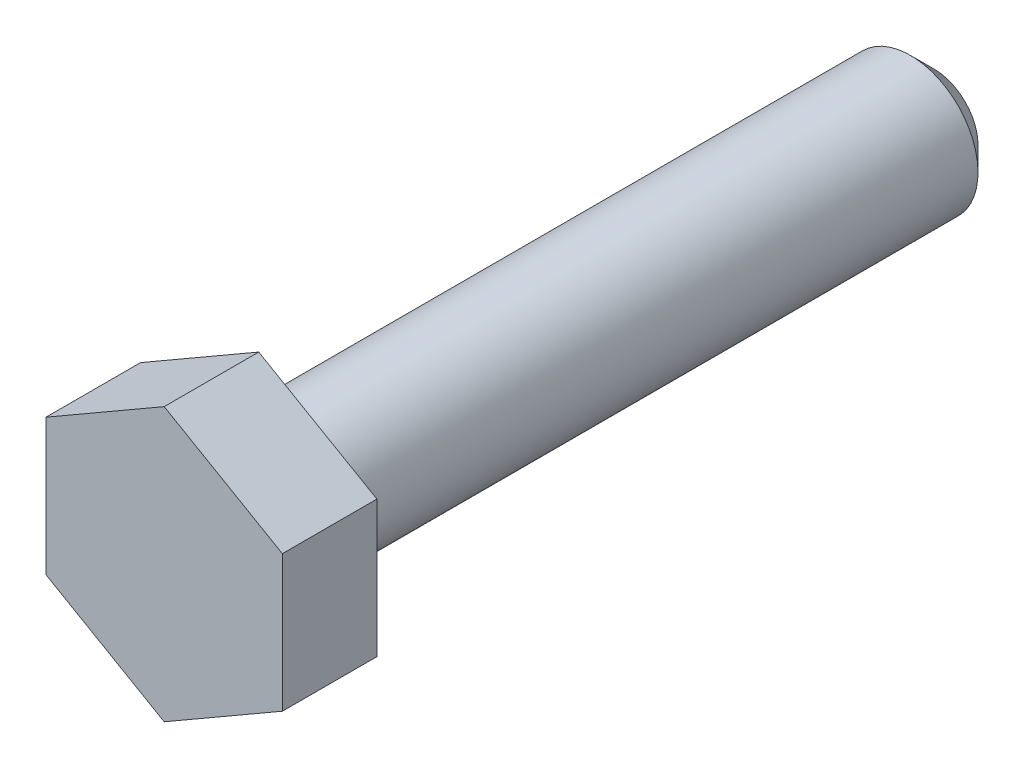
ISO-10303-21;
HEADER;
FILE_DESCRIPTION(('STEP AP214'),'2;1');
FILE_NAME('part.step','',(''),(''),'','','');
FILE_SCHEMA(('AUTOMOTIVE_DESIGN { 1 0 10303 214 1 1 1 1 }'));
ENDSEC;
DATA;
#1=APPLICATION_CONTEXT('core data for automotive mechanical design processes');
#2=APPLICATION_PROTOCOL_DEFINITION('international standard','automotive_design',2000,#1);
#3=PRODUCT_CONTEXT('',#1,'mechanical');
#4=PRODUCT('Part','Part','',(#3));
#5=PRODUCT_RELATED_PRODUCT_CATEGORY('part','',(#4));
#6=PRODUCT_DEFINITION_FORMATION('','',#4);
#7=PRODUCT_DEFINITION_CONTEXT('part definition',#1,'design');
#8=PRODUCT_DEFINITION('design','',#6,#7);
#9=PRODUCT_DEFINITION_SHAPE('','',#8);
#10=(LENGTH_UNIT() NAMED_UNIT(*) SI_UNIT(.MILLI.,.METRE.));
#11=(NAMED_UNIT(*) PLANE_ANGLE_UNIT() SI_UNIT($,.RADIAN.));
#12=(NAMED_UNIT(*) SI_UNIT($,.STERADIAN.) SOLID_ANGLE_UNIT());
#13=UNCERTAINTY_MEASURE_WITH_UNIT(LENGTH_MEASURE(1.E-05),#10,'distance_accuracy_value','');
#14=(GEOMETRIC_REPRESENTATION_CONTEXT(3) GLOBAL_UNCERTAINTY_ASSIGNED_CONTEXT((#13)) GLOBAL_UNIT_ASSIGNED_CONTEXT((#10,
#11,#12)) REPRESENTATION_CONTEXT('',''));
#15=CARTESIAN_POINT('',(0.,0.,0.));
#16=DIRECTION('',(0.,0.,1.));
#17=DIRECTION('',(1.,0.,0.));
#18=AXIS2_PLACEMENT_3D('',#15,#16,#17);
#19=CARTESIAN_POINT('',(7.,0.,0.));
#20=DIRECTION('',(0.,0.,-1.));
#21=DIRECTION('',(0.,1.,0.));
#22=AXIS2_PLACEMENT_3D('',#19,#20,#21);
#23=PLANE('',#22);
#24=DIRECTION('',(-0.86602540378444,0.5,0.));
#25=VECTOR('',#24,1.);
#26=CARTESIAN_POINT('',(3.5,2.02072594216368,0.));
#27=LINE('',#26,#25);
#28=CARTESIAN_POINT('',(3.5,2.02072594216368,0.));
#29=VERTEX_POINT('',#28);
#30=CARTESIAN_POINT('',(0.,4.04145188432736,0.));
#31=VERTEX_POINT('',#30);
#32=EDGE_CURVE('E100',#29,#31,#27,.T.);
#33=ORIENTED_EDGE('',*,*,#32,.F.);
#34=DIRECTION('',(0.,1.,0.));
#35=VECTOR('',#34,1.);
#36=CARTESIAN_POINT('',(3.5,-2.0207259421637,0.));
#37=LINE('',#36,#35);
#38=CARTESIAN_POINT('',(3.5,-2.0207259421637,0.));
#39=VERTEX_POINT('',#38);
#40=EDGE_CURVE('E60',#39,#29,#37,.T.);
#41=ORIENTED_EDGE('',*,*,#40,.F.);
#42=DIRECTION('',(0.86602540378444,0.5,0.));
#43=VECTOR('',#42,1.);
#44=CARTESIAN_POINT('',(0.,-4.0414518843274,0.));
#45=LINE('',#44,#43);
#46=CARTESIAN_POINT('',(0.,-4.0414518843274,0.));
#47=VERTEX_POINT('',#46);
#48=EDGE_CURVE('E54',#47,#39,#45,.T.);
#49=ORIENTED_EDGE('',*,*,#48,.F.);
#50=DIRECTION('',(0.86602540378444,-0.5,0.));
#51=VECTOR('',#50,1.);
#52=CARTESIAN_POINT('',(-3.5,-2.02072594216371,0.));
#53=LINE('',#52,#51);
#54=CARTESIAN_POINT('',(-3.5,-2.02072594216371,0.));
#55=VERTEX_POINT('',#54);
#56=EDGE_CURVE('E90',#55,#47,#53,.T.);
#57=ORIENTED_EDGE('',*,*,#56,.F.);
#58=DIRECTION('',(0.,-1.,0.));
#59=VECTOR('',#58,1.);
#60=CARTESIAN_POINT('',(-3.5,2.02072594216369,0.));
#61=LINE('',#60,#59);
#62=CARTESIAN_POINT('',(-3.5,2.02072594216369,0.));
#63=VERTEX_POINT('',#62);
#64=EDGE_CURVE('E106',#63,#55,#61,.T.);
#65=ORIENTED_EDGE('',*,*,#64,.F.);
#66=DIRECTION('',(-0.86602540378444,-0.5,0.));
#67=VECTOR('',#66,1.);
#68=CARTESIAN_POINT('',(0.,4.04145188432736,0.));
#69=LINE('',#68,#67);
#70=EDGE_CURVE('E103',#31,#63,#69,.T.);
#71=ORIENTED_EDGE('',*,*,#70,.F.);
#72=EDGE_LOOP('',(#33,#41,#49,#57,#65,#71));
#73=FACE_BOUND('',#72,.T.);
#74=CARTESIAN_POINT('',(0.,0.,0.));
#75=DIRECTION('',(0.,0.,1.));
#76=DIRECTION('',(0.,-1.,0.));
#77=AXIS2_PLACEMENT_3D('',#74,#75,#76);
#78=CIRCLE('',#77,2.);
#79=CARTESIAN_POINT('',(0.,-2.,0.));
#80=VERTEX_POINT('',#79);
#81=EDGE_CURVE('E104',#80,#80,#78,.T.);
#82=ORIENTED_EDGE('',*,*,#81,.T.);
#83=EDGE_LOOP('',(#82));
#84=FACE_BOUND('',#83,.T.);
#85=ADVANCED_FACE('F14',(#73,#84),#23,.T.);
#86=CARTESIAN_POINT('',(3.5,2.02072594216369,2.8));
#87=DIRECTION('',(-0.5,-0.86602540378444,0.));
#88=DIRECTION('',(0.86602540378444,-0.5,0.));
#89=AXIS2_PLACEMENT_3D('',#86,#87,#88);
#90=PLANE('',#89);
#91=ORIENTED_EDGE('',*,*,#32,.T.);
#92=DIRECTION('',(0.,0.,-1.));
#93=VECTOR('',#92,1.);
#94=CARTESIAN_POINT('',(0.,4.04145188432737,2.8));
#95=LINE('',#94,#93);
#96=CARTESIAN_POINT('',(0.,4.04145188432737,2.8));
#97=VERTEX_POINT('',#96);
#98=EDGE_CURVE('E118',#97,#31,#95,.T.);
#99=ORIENTED_EDGE('',*,*,#98,.F.);
#100=DIRECTION('',(-0.86602540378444,0.5,0.));
#101=VECTOR('',#100,1.);
#102=CARTESIAN_POINT('',(3.5,2.02072594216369,2.8));
#103=LINE('',#102,#101);
#104=CARTESIAN_POINT('',(3.5,2.02072594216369,2.8));
#105=VERTEX_POINT('',#104);
#106=EDGE_CURVE('E111',#105,#97,#103,.T.);
#107=ORIENTED_EDGE('',*,*,#106,.F.);
#108=DIRECTION('',(0.,0.,-1.));
#109=VECTOR('',#108,1.);
#110=CARTESIAN_POINT('',(3.5,2.02072594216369,2.8));
#111=LINE('',#110,#109);
#112=EDGE_CURVE('E96',#105,#29,#111,.T.);
#113=ORIENTED_EDGE('',*,*,#112,.T.);
#114=EDGE_LOOP('',(#91,#99,#107,#113));
#115=FACE_BOUND('',#114,.T.);
#116=ADVANCED_FACE('F137',(#115),#90,.F.);
#117=CARTESIAN_POINT('',(0.,4.04145188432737,2.8));
#118=DIRECTION('',(0.5,-0.86602540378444,0.));
#119=DIRECTION('',(0.86602540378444,0.5,0.));
#120=AXIS2_PLACEMENT_3D('',#117,#118,#119);
#121=PLANE('',#120);
#122=ORIENTED_EDGE('',*,*,#70,.T.);
#123=DIRECTION('',(0.,0.,-1.));
#124=VECTOR('',#123,1.);
#125=CARTESIAN_POINT('',(-3.5,2.02072594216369,2.8));
#126=LINE('',#125,#124);
#127=CARTESIAN_POINT('',(-3.5,2.02072594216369,2.8));
#128=VERTEX_POINT('',#127);
#129=EDGE_CURVE('E115',#128,#63,#126,.T.);
#130=ORIENTED_EDGE('',*,*,#129,.F.);
#131=DIRECTION('',(-0.86602540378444,-0.5,0.));
#132=VECTOR('',#131,1.);
#133=CARTESIAN_POINT('',(0.,4.04145188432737,2.8));
#134=LINE('',#133,#132);
#135=EDGE_CURVE('E69',#97,#128,#134,.T.);
#136=ORIENTED_EDGE('',*,*,#135,.F.);
#137=ORIENTED_EDGE('',*,*,#98,.T.);
#138=EDGE_LOOP('',(#122,#130,#136,#137));
#139=FACE_BOUND('',#138,.T.);
#140=ADVANCED_FACE('F144',(#139),#121,.F.);
#141=CARTESIAN_POINT('',(-3.5,2.02072594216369,2.8));
#142=DIRECTION('',(1.,0.,0.));
#143=DIRECTION('',(0.,1.,0.));
#144=AXIS2_PLACEMENT_3D('',#141,#142,#143);
#145=PLANE('',#144);
#146=ORIENTED_EDGE('',*,*,#64,.T.);
#147=DIRECTION('',(0.,0.,-1.));
#148=VECTOR('',#147,1.);
#149=CARTESIAN_POINT('',(-3.5,-2.02072594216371,2.8));
#150=LINE('',#149,#148);
#151=CARTESIAN_POINT('',(-3.5,-2.02072594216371,2.8));
#152=VERTEX_POINT('',#151);
#153=EDGE_CURVE('E91',#152,#55,#150,.T.);
#154=ORIENTED_EDGE('',*,*,#153,.F.);
#155=DIRECTION('',(0.,-1.,0.));
#156=VECTOR('',#155,1.);
#157=CARTESIAN_POINT('',(-3.5,2.02072594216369,2.8));
#158=LINE('',#157,#156);
#159=EDGE_CURVE('E82',#128,#152,#158,.T.);
#160=ORIENTED_EDGE('',*,*,#159,.F.);
#161=ORIENTED_EDGE('',*,*,#129,.T.);
#162=EDGE_LOOP('',(#146,#154,#160,#161));
#163=FACE_BOUND('',#162,.T.);
#164=ADVANCED_FACE('F158',(#163),#145,.F.);
#165=CARTESIAN_POINT('',(-3.5,-2.02072594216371,2.8));
#166=DIRECTION('',(0.5,0.86602540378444,0.));
#167=DIRECTION('',(-0.86602540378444,0.5,0.));
#168=AXIS2_PLACEMENT_3D('',#165,#166,#167);
#169=PLANE('',#168);
#170=ORIENTED_EDGE('',*,*,#56,.T.);
#171=DIRECTION('',(0.,0.,-1.));
#172=VECTOR('',#171,1.);
#173=CARTESIAN_POINT('',(0.,-4.04145188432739,2.79999999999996));
#174=LINE('',#173,#172);
#175=CARTESIAN_POINT('',(0.,-4.04145188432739,2.79999999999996));
#176=VERTEX_POINT('',#175);
#177=EDGE_CURVE('E87',#176,#47,#174,.T.);
#178=ORIENTED_EDGE('',*,*,#177,.F.);
#179=DIRECTION('',(0.86602540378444,-0.5,0.));
#180=VECTOR('',#179,1.);
#181=CARTESIAN_POINT('',(-3.5,-2.02072594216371,2.8));
#182=LINE('',#181,#180);
#183=EDGE_CURVE('E76',#152,#176,#182,.T.);
#184=ORIENTED_EDGE('',*,*,#183,.F.);
#185=ORIENTED_EDGE('',*,*,#153,.T.);
#186=EDGE_LOOP('',(#170,#178,#184,#185));
#187=FACE_BOUND('',#186,.T.);
#188=ADVANCED_FACE('F88',(#187),#169,.F.);
#189=CARTESIAN_POINT('',(0.,-4.04145188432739,2.79999999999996));
#190=DIRECTION('',(-0.5,0.86602540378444,0.));
#191=DIRECTION('',(-0.86602540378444,-0.5,0.));
#192=AXIS2_PLACEMENT_3D('',#189,#190,#191);
#193=PLANE('',#192);
#194=ORIENTED_EDGE('',*,*,#48,.T.);
#195=DIRECTION('',(0.,0.,-1.));
#196=VECTOR('',#195,1.);
#197=CARTESIAN_POINT('',(3.5,-2.02072594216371,2.8));
#198=LINE('',#197,#196);
#199=CARTESIAN_POINT('',(3.5,-2.02072594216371,2.8));
#200=VERTEX_POINT('',#199);
#201=EDGE_CURVE('E92',#200,#39,#198,.T.);
#202=ORIENTED_EDGE('',*,*,#201,.F.);
#203=DIRECTION('',(0.86602540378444,0.5,0.));
#204=VECTOR('',#203,1.);
#205=CARTESIAN_POINT('',(0.,-4.04145188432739,2.79999999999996));
#206=LINE('',#205,#204);
#207=EDGE_CURVE('E80',#176,#200,#206,.T.);
#208=ORIENTED_EDGE('',*,*,#207,.F.);
#209=ORIENTED_EDGE('',*,*,#177,.T.);
#210=EDGE_LOOP('',(#194,#202,#208,#209));
#211=FACE_BOUND('',#210,.T.);
#212=ADVANCED_FACE('F94',(#211),#193,.F.);
#213=CARTESIAN_POINT('',(3.5,-2.02072594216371,2.8));
#214=DIRECTION('',(-1.,0.,0.));
#215=DIRECTION('',(0.,-1.,0.));
#216=AXIS2_PLACEMENT_3D('',#213,#214,#215);
#217=PLANE('',#216);
#218=ORIENTED_EDGE('',*,*,#40,.T.);
#219=ORIENTED_EDGE('',*,*,#112,.F.);
#220=DIRECTION('',(0.,1.,0.));
#221=VECTOR('',#220,1.);
#222=CARTESIAN_POINT('',(3.5,-2.02072594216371,2.8));
#223=LINE('',#222,#221);
#224=EDGE_CURVE('E31',#200,#105,#223,.T.);
#225=ORIENTED_EDGE('',*,*,#224,.F.);
#226=ORIENTED_EDGE('',*,*,#201,.T.);
#227=EDGE_LOOP('',(#218,#219,#225,#226));
#228=FACE_BOUND('',#227,.T.);
#229=ADVANCED_FACE('F151',(#228),#217,.F.);
#230=CARTESIAN_POINT('',(7.,0.,2.8));
#231=DIRECTION('',(0.,0.,-1.));
#232=DIRECTION('',(0.,1.,0.));
#233=AXIS2_PLACEMENT_3D('',#230,#231,#232);
#234=PLANE('',#233);
#235=ORIENTED_EDGE('',*,*,#106,.T.);
#236=ORIENTED_EDGE('',*,*,#135,.T.);
#237=ORIENTED_EDGE('',*,*,#159,.T.);
#238=ORIENTED_EDGE('',*,*,#183,.T.);
#239=ORIENTED_EDGE('',*,*,#207,.T.);
#240=ORIENTED_EDGE('',*,*,#224,.T.);
#241=EDGE_LOOP('',(#235,#236,#237,#238,#239,#240));
#242=FACE_BOUND('',#241,.T.);
#243=ADVANCED_FACE('F78',(#242),#234,.F.);
#244=CARTESIAN_POINT('',(0.,0.,0.));
#245=DIRECTION('',(0.,0.,1.));
#246=DIRECTION('',(0.,-1.,0.));
#247=AXIS2_PLACEMENT_3D('',#244,#245,#246);
#248=CYLINDRICAL_SURFACE('',#247,2.);
#249=CARTESIAN_POINT('',(0.,0.,-19.3));
#250=DIRECTION('',(0.,0.,1.));
#251=DIRECTION('',(0.,-1.,0.));
#252=AXIS2_PLACEMENT_3D('',#249,#250,#251);
#253=CIRCLE('',#252,2.);
#254=CARTESIAN_POINT('',(0.,-2.00000000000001,-19.3));
#255=VERTEX_POINT('',#254);
#256=EDGE_CURVE('E23',#255,#255,#253,.T.);
#257=ORIENTED_EDGE('',*,*,#256,.T.);
#258=EDGE_LOOP('',(#257));
#259=FACE_BOUND('',#258,.T.);
#260=ORIENTED_EDGE('',*,*,#81,.F.);
#261=EDGE_LOOP('',(#260));
#262=FACE_BOUND('',#261,.T.);
#263=ADVANCED_FACE('F122',(#259,#262),#248,.T.);
#264=CARTESIAN_POINT('',(2.,0.,-20.));
#265=DIRECTION('',(0.,0.,1.));
#266=DIRECTION('',(0.,-1.,0.));
#267=AXIS2_PLACEMENT_3D('',#264,#265,#266);
#268=PLANE('',#267);
#269=CARTESIAN_POINT('',(0.,0.,-20.));
#270=DIRECTION('',(0.,0.,1.));
#271=DIRECTION('',(0.,-1.,0.));
#272=AXIS2_PLACEMENT_3D('',#269,#270,#271);
#273=CIRCLE('',#272,1.3);
#274=CARTESIAN_POINT('',(0.,-1.30000000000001,-20.));
#275=VERTEX_POINT('',#274);
#276=EDGE_CURVE('E9',#275,#275,#273,.F.);
#277=ORIENTED_EDGE('',*,*,#276,.T.);
#278=EDGE_LOOP('',(#277));
#279=FACE_BOUND('',#278,.T.);
#280=ADVANCED_FACE('F126',(#279),#268,.F.);
#281=CARTESIAN_POINT('',(0.,0.,-19.3));
#282=DIRECTION('',(0.,0.,1.));
#283=DIRECTION('',(0.,-1.,0.));
#284=AXIS2_PLACEMENT_3D('',#281,#282,#283);
#285=CONICAL_SURFACE('',#284,2.,0.785398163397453);
#286=ORIENTED_EDGE('',*,*,#276,.F.);
#287=EDGE_LOOP('',(#286));
#288=FACE_BOUND('',#287,.T.);
#289=ORIENTED_EDGE('',*,*,#256,.F.);
#290=EDGE_LOOP('',(#289));
#291=FACE_BOUND('',#290,.T.);
#292=ADVANCED_FACE('F16',(#288,#291),#285,.T.);
#293=CLOSED_SHELL('',(#85,#116,#140,#164,#188,#212,#229,#243,#263,#280,#292));
#294=MANIFOLD_SOLID_BREP('B1',#293);
#295=ADVANCED_BREP_SHAPE_REPRESENTATION('',(#18,#294),#14);
#296=SHAPE_DEFINITION_REPRESENTATION(#9,#295);
ENDSEC;
END-ISO-10303-21;
